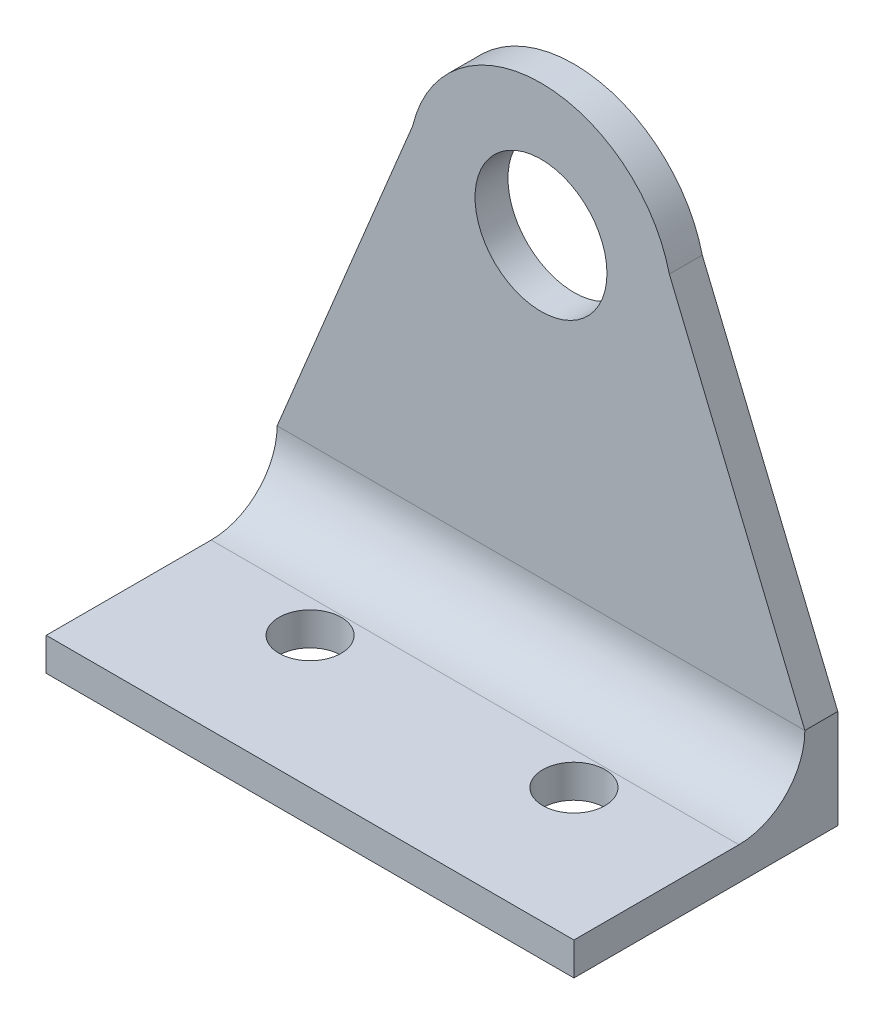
from build123d import *

# Parameters (mm, degrees)
BOSS_EXTRUDE2_DEPTH      = 25.4
FILLET2_R                = 6.35
F_6_0_6_DIAMETER_HOLE2_D = 6
SKETCH15_R               = 6.35
CUT_EXTRUDE1_DEPTH       = 61.991580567
CUT_EXTRUDE2_DEPTH       = 61.991580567


with BuildPart() as part:
    # Sketch1 → Boss-Extrude2 (new, symmetric)
    with BuildSketch(Plane(origin=(0, 0, 0), x_dir=(0, 0, -1), z_dir=(1, 0, 0))):
        Polygon((0, 0), (25.4, 0), (25.4, 50.8), (22.23, 50.8), (22.23, 3.17), (0, 3.17), align=None)
    extrude(amount=BOSS_EXTRUDE2_DEPTH, both=True)

    # Fillet2
    fillet2_edges = [part.edges().sort_by_distance(p)[0] for p in [
        (0, 3.17, -22.23),
    ]]
    fillet(fillet2_edges, radius=FILLET2_R)

    # 6.0 _6_ Diameter Hole2 (through all)
    with Locations(Plane(origin=(0, 3.17, 0), x_dir=(-1, 0, 0), z_dir=(0, 1, 0))):
        with Locations((12.7, -12.7), (-12.7, -12.7)):
            Hole(F_6_0_6_DIAMETER_HOLE2_D / 2)

    # Sketch15 → Cut-Extrude1 (cut, through all)
    with BuildSketch(Plane.XY.offset(-22.23)):
        with Locations((0, 38.1)):
            Circle(SKETCH15_R)
    extrude(amount=-CUT_EXTRUDE1_DEPTH, mode=Mode.SUBTRACT)

    # Sketch14 → Cut-Extrude2 (cut, through all)
    with BuildSketch(Plane.XY.offset(-22.23)):
        with BuildLine():
            Line((-25.4, 50.8), (-25.4, 9.52))
            Line((-25.4, 9.52), (-12.354609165, 41.041705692))
            ThreePointArc((-12.354609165, 41.041705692), (-7.871795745, 48.066184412), (9.7e-08, 50.8))
            Line((9.7e-08, 50.8), (-25.4, 50.8))
        make_face()
        with BuildLine():
            Line((12.354609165, 41.041705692), (25.4, 9.52))
            Line((25.4, 9.52), (25.4, 50.8))
            Line((25.4, 50.8), (9.7e-08, 50.8))
            ThreePointArc((9.7e-08, 50.8), (7.871795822, 48.066184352), (12.354609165, 41.041705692))
        make_face()
    extrude(amount=-CUT_EXTRUDE2_DEPTH, mode=Mode.SUBTRACT)


solid = part.part
